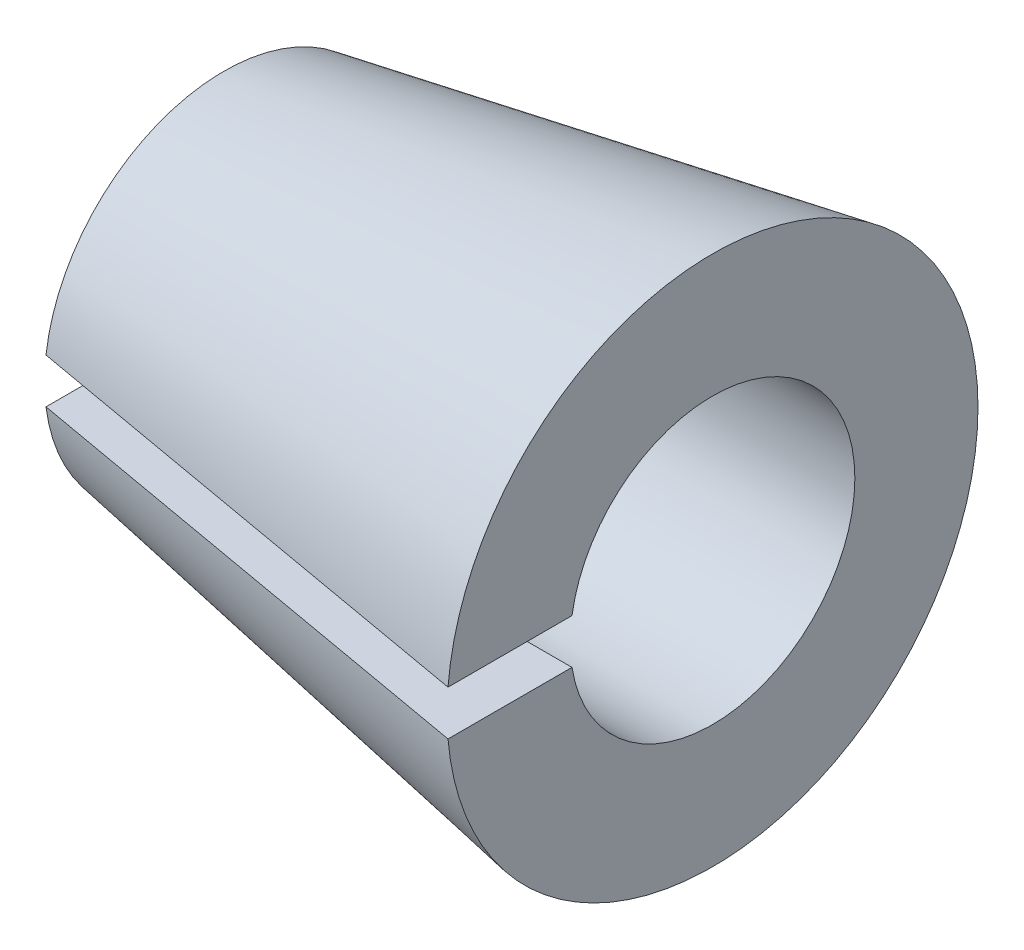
from build123d import *

# Parameters (mm, degrees)
SKETCH2_W          = 6.882917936
SKETCH2_H          = 1
CUT_EXTRUDE1_DEPTH = 14.745883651


with BuildPart() as part:
    # Sketch1 → Revolve1 (revolve)
    with BuildSketch(Plane.XY, mode=Mode.PRIVATE) as revolve1_sk:
        Polygon((10.9, 3.175), (10.9, 5.92196409), (0, 4), (0, 3.175), align=None)
    revolve(revolve1_sk.sketch.rotate(Axis((0, 0, 0), (1, 0, 0)), 90), axis=Axis((0, 0, 0), (1, 0, 0)))

    # Sketch2 → Cut-Extrude1 (cut, through all)
    with BuildSketch(Plane(origin=(10.9, 0, 0), x_dir=(0, 0, -1), z_dir=(1, 0, 0))):
        with Locations((-3.441458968, 0)):
            Rectangle(SKETCH2_W, SKETCH2_H)
    extrude(amount=-CUT_EXTRUDE1_DEPTH, mode=Mode.SUBTRACT)


solid = part.part
